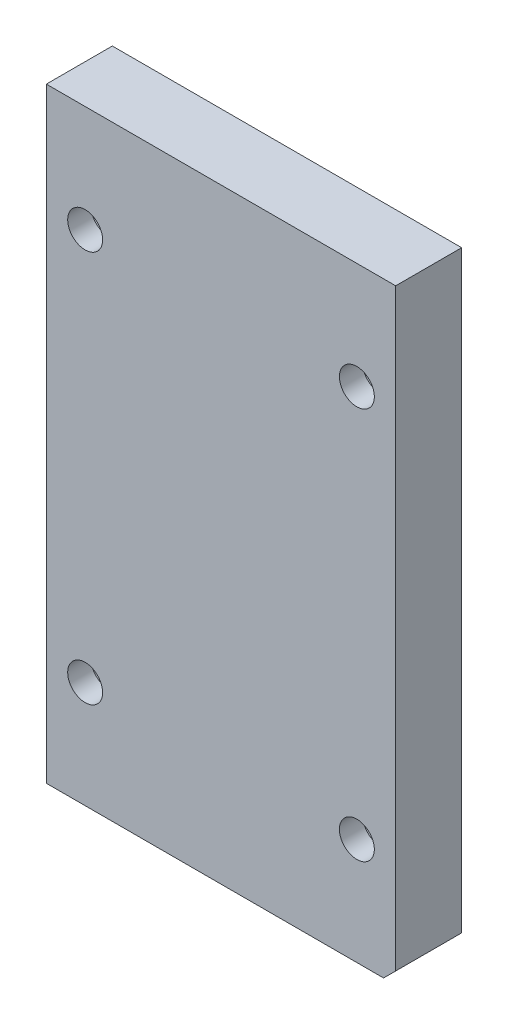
ISO-10303-21;
HEADER;
FILE_DESCRIPTION(('STEP AP214'),'2;1');
FILE_NAME('part.step','',(''),(''),'','','');
FILE_SCHEMA(('AUTOMOTIVE_DESIGN { 1 0 10303 214 1 1 1 1 }'));
ENDSEC;
DATA;
#1=APPLICATION_CONTEXT('core data for automotive mechanical design processes');
#2=APPLICATION_PROTOCOL_DEFINITION('international standard','automotive_design',2000,#1);
#3=PRODUCT_CONTEXT('',#1,'mechanical');
#4=PRODUCT('Part','Part','',(#3));
#5=PRODUCT_RELATED_PRODUCT_CATEGORY('part','',(#4));
#6=PRODUCT_DEFINITION_FORMATION('','',#4);
#7=PRODUCT_DEFINITION_CONTEXT('part definition',#1,'design');
#8=PRODUCT_DEFINITION('design','',#6,#7);
#9=PRODUCT_DEFINITION_SHAPE('','',#8);
#10=(LENGTH_UNIT() NAMED_UNIT(*) SI_UNIT(.MILLI.,.METRE.));
#11=(NAMED_UNIT(*) PLANE_ANGLE_UNIT() SI_UNIT($,.RADIAN.));
#12=(NAMED_UNIT(*) SI_UNIT($,.STERADIAN.) SOLID_ANGLE_UNIT());
#13=UNCERTAINTY_MEASURE_WITH_UNIT(LENGTH_MEASURE(1.E-05),#10,'distance_accuracy_value','');
#14=(GEOMETRIC_REPRESENTATION_CONTEXT(3) GLOBAL_UNCERTAINTY_ASSIGNED_CONTEXT((#13)) GLOBAL_UNIT_ASSIGNED_CONTEXT((#10,
#11,#12)) REPRESENTATION_CONTEXT('',''));
#15=CARTESIAN_POINT('',(0.,0.,0.));
#16=DIRECTION('',(0.,0.,1.));
#17=DIRECTION('',(1.,0.,0.));
#18=AXIS2_PLACEMENT_3D('',#15,#16,#17);
#19=CARTESIAN_POINT('',(-45.,78.,-197.099972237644));
#20=DIRECTION('',(0.,1.,0.));
#21=DIRECTION('',(-1.,0.,0.));
#22=AXIS2_PLACEMENT_3D('',#19,#20,#21);
#23=PLANE('',#22);
#24=DIRECTION('',(1.,0.,0.));
#25=VECTOR('',#24,1.);
#26=CARTESIAN_POINT('',(-45.,78.,-17.));
#27=LINE('',#26,#25);
#28=CARTESIAN_POINT('',(-45.,78.,-17.));
#29=VERTEX_POINT('',#28);
#30=CARTESIAN_POINT('',(45.,78.,-17.));
#31=VERTEX_POINT('',#30);
#32=EDGE_CURVE('E197',#29,#31,#27,.T.);
#33=ORIENTED_EDGE('',*,*,#32,.F.);
#34=DIRECTION('',(0.,0.,1.));
#35=VECTOR('',#34,1.);
#36=CARTESIAN_POINT('',(-45.,78.,-197.099972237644));
#37=LINE('',#36,#35);
#38=CARTESIAN_POINT('',(-45.,78.,0.));
#39=VERTEX_POINT('',#38);
#40=EDGE_CURVE('E209',#29,#39,#37,.T.);
#41=ORIENTED_EDGE('',*,*,#40,.T.);
#42=DIRECTION('',(-1.,0.,0.));
#43=VECTOR('',#42,1.);
#44=CARTESIAN_POINT('',(-45.,78.,0.));
#45=LINE('',#44,#43);
#46=CARTESIAN_POINT('',(45.,78.,0.));
#47=VERTEX_POINT('',#46);
#48=EDGE_CURVE('E191',#47,#39,#45,.T.);
#49=ORIENTED_EDGE('',*,*,#48,.F.);
#50=DIRECTION('',(0.,0.,1.));
#51=VECTOR('',#50,1.);
#52=CARTESIAN_POINT('',(45.,78.,-197.099972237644));
#53=LINE('',#52,#51);
#54=EDGE_CURVE('E195',#31,#47,#53,.T.);
#55=ORIENTED_EDGE('',*,*,#54,.F.);
#56=EDGE_LOOP('',(#33,#41,#49,#55));
#57=FACE_BOUND('',#56,.T.);
#58=ADVANCED_FACE('F34',(#57),#23,.T.);
#59=CARTESIAN_POINT('',(45.,78.,-197.099972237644));
#60=DIRECTION('',(1.,0.,0.));
#61=DIRECTION('',(0.,1.,0.));
#62=AXIS2_PLACEMENT_3D('',#59,#60,#61);
#63=PLANE('',#62);
#64=DIRECTION('',(0.,1.,0.));
#65=VECTOR('',#64,1.);
#66=CARTESIAN_POINT('',(45.,78.,0.));
#67=LINE('',#66,#65);
#68=CARTESIAN_POINT('',(45.,-74.8799999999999,0.));
#69=VERTEX_POINT('',#68);
#70=EDGE_CURVE('E207',#69,#47,#67,.T.);
#71=ORIENTED_EDGE('',*,*,#70,.F.);
#72=DIRECTION('',(0.,0.,-1.));
#73=VECTOR('',#72,1.);
#74=CARTESIAN_POINT('',(45.,-74.8799999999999,-197.099972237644));
#75=LINE('',#74,#73);
#76=CARTESIAN_POINT('',(45.,-74.8799999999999,-17.));
#77=VERTEX_POINT('',#76);
#78=EDGE_CURVE('E42',#69,#77,#75,.T.);
#79=ORIENTED_EDGE('',*,*,#78,.T.);
#80=DIRECTION('',(0.,-1.,0.));
#81=VECTOR('',#80,1.);
#82=CARTESIAN_POINT('',(45.,78.,-17.));
#83=LINE('',#82,#81);
#84=EDGE_CURVE('E194',#31,#77,#83,.T.);
#85=ORIENTED_EDGE('',*,*,#84,.F.);
#86=ORIENTED_EDGE('',*,*,#54,.T.);
#87=EDGE_LOOP('',(#71,#79,#85,#86));
#88=FACE_BOUND('',#87,.T.);
#89=ADVANCED_FACE('F239',(#88),#63,.T.);
#90=CARTESIAN_POINT('',(-45.,-78.,-197.099972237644));
#91=DIRECTION('',(0.,-1.,0.));
#92=DIRECTION('',(1.,0.,0.));
#93=AXIS2_PLACEMENT_3D('',#90,#91,#92);
#94=PLANE('',#93);
#95=DIRECTION('',(-1.,0.,0.));
#96=VECTOR('',#95,1.);
#97=CARTESIAN_POINT('',(-45.,-78.,-17.));
#98=LINE('',#97,#96);
#99=CARTESIAN_POINT('',(41.88,-78.,-17.));
#100=VERTEX_POINT('',#99);
#101=CARTESIAN_POINT('',(-45.,-78.,-17.));
#102=VERTEX_POINT('',#101);
#103=EDGE_CURVE('E192',#100,#102,#98,.T.);
#104=ORIENTED_EDGE('',*,*,#103,.F.);
#105=DIRECTION('',(0.,0.,1.));
#106=VECTOR('',#105,1.);
#107=CARTESIAN_POINT('',(41.88,-78.,-197.099972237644));
#108=LINE('',#107,#106);
#109=CARTESIAN_POINT('',(41.8799999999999,-78.,0.));
#110=VERTEX_POINT('',#109);
#111=EDGE_CURVE('E216',#100,#110,#108,.T.);
#112=ORIENTED_EDGE('',*,*,#111,.T.);
#113=DIRECTION('',(1.,0.,0.));
#114=VECTOR('',#113,1.);
#115=CARTESIAN_POINT('',(-45.,-78.,0.));
#116=LINE('',#115,#114);
#117=CARTESIAN_POINT('',(-45.,-78.,0.));
#118=VERTEX_POINT('',#117);
#119=EDGE_CURVE('E205',#118,#110,#116,.T.);
#120=ORIENTED_EDGE('',*,*,#119,.F.);
#121=DIRECTION('',(0.,0.,1.));
#122=VECTOR('',#121,1.);
#123=CARTESIAN_POINT('',(-45.,-78.,-197.099972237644));
#124=LINE('',#123,#122);
#125=EDGE_CURVE('E212',#102,#118,#124,.T.);
#126=ORIENTED_EDGE('',*,*,#125,.F.);
#127=EDGE_LOOP('',(#104,#112,#120,#126));
#128=FACE_BOUND('',#127,.T.);
#129=ADVANCED_FACE('F223',(#128),#94,.T.);
#130=CARTESIAN_POINT('',(-45.,78.,-197.099972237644));
#131=DIRECTION('',(-1.,0.,0.));
#132=DIRECTION('',(0.,-1.,0.));
#133=AXIS2_PLACEMENT_3D('',#130,#131,#132);
#134=PLANE('',#133);
#135=DIRECTION('',(0.,1.,0.));
#136=VECTOR('',#135,1.);
#137=CARTESIAN_POINT('',(-45.,78.,-17.));
#138=LINE('',#137,#136);
#139=EDGE_CURVE('E199',#102,#29,#138,.T.);
#140=ORIENTED_EDGE('',*,*,#139,.F.);
#141=ORIENTED_EDGE('',*,*,#125,.T.);
#142=DIRECTION('',(0.,-1.,0.));
#143=VECTOR('',#142,1.);
#144=CARTESIAN_POINT('',(-45.,78.,0.));
#145=LINE('',#144,#143);
#146=EDGE_CURVE('E202',#39,#118,#145,.T.);
#147=ORIENTED_EDGE('',*,*,#146,.F.);
#148=ORIENTED_EDGE('',*,*,#40,.F.);
#149=EDGE_LOOP('',(#140,#141,#147,#148));
#150=FACE_BOUND('',#149,.T.);
#151=ADVANCED_FACE('F233',(#150),#134,.T.);
#152=CARTESIAN_POINT('',(0.,0.,0.));
#153=DIRECTION('',(0.,0.,-1.));
#154=DIRECTION('',(-1.,0.,0.));
#155=AXIS2_PLACEMENT_3D('',#152,#153,#154);
#156=PLANE('',#155);
#157=CARTESIAN_POINT('',(34.9999999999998,-50.5,0.));
#158=DIRECTION('',(0.,0.,-1.));
#159=DIRECTION('',(-1.,0.,0.));
#160=AXIS2_PLACEMENT_3D('',#157,#158,#159);
#161=CIRCLE('',#160,4.5);
#162=CARTESIAN_POINT('',(30.4999999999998,-50.5,0.));
#163=VERTEX_POINT('',#162);
#164=EDGE_CURVE('E152',#163,#163,#161,.T.);
#165=ORIENTED_EDGE('',*,*,#164,.T.);
#166=EDGE_LOOP('',(#165));
#167=FACE_BOUND('',#166,.T.);
#168=CARTESIAN_POINT('',(-35.,-50.5000000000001,0.));
#169=DIRECTION('',(0.,0.,-1.));
#170=DIRECTION('',(-1.,0.,0.));
#171=AXIS2_PLACEMENT_3D('',#168,#169,#170);
#172=CIRCLE('',#171,4.5);
#173=CARTESIAN_POINT('',(-39.5,-50.5000000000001,0.));
#174=VERTEX_POINT('',#173);
#175=EDGE_CURVE('E164',#174,#174,#172,.T.);
#176=ORIENTED_EDGE('',*,*,#175,.T.);
#177=EDGE_LOOP('',(#176));
#178=FACE_BOUND('',#177,.T.);
#179=CARTESIAN_POINT('',(-35.,50.5,0.));
#180=DIRECTION('',(0.,0.,-1.));
#181=DIRECTION('',(-1.,0.,0.));
#182=AXIS2_PLACEMENT_3D('',#179,#180,#181);
#183=CIRCLE('',#182,4.5);
#184=CARTESIAN_POINT('',(-39.5,50.5,0.));
#185=VERTEX_POINT('',#184);
#186=EDGE_CURVE('E176',#185,#185,#183,.T.);
#187=ORIENTED_EDGE('',*,*,#186,.T.);
#188=EDGE_LOOP('',(#187));
#189=FACE_BOUND('',#188,.T.);
#190=CARTESIAN_POINT('',(35.,50.5,0.));
#191=DIRECTION('',(0.,0.,-1.));
#192=DIRECTION('',(-1.,0.,0.));
#193=AXIS2_PLACEMENT_3D('',#190,#191,#192);
#194=CIRCLE('',#193,4.5);
#195=CARTESIAN_POINT('',(30.5,50.5,0.));
#196=VERTEX_POINT('',#195);
#197=EDGE_CURVE('E188',#196,#196,#194,.T.);
#198=ORIENTED_EDGE('',*,*,#197,.T.);
#199=EDGE_LOOP('',(#198));
#200=FACE_BOUND('',#199,.T.);
#201=ORIENTED_EDGE('',*,*,#119,.T.);
#202=DIRECTION('',(-0.707106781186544,-0.707106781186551,0.));
#203=VECTOR('',#202,1.);
#204=CARTESIAN_POINT('',(41.88,-78.,0.));
#205=LINE('',#204,#203);
#206=EDGE_CURVE('E56',#110,#69,#205,.F.);
#207=ORIENTED_EDGE('',*,*,#206,.T.);
#208=ORIENTED_EDGE('',*,*,#70,.T.);
#209=ORIENTED_EDGE('',*,*,#48,.T.);
#210=ORIENTED_EDGE('',*,*,#146,.T.);
#211=EDGE_LOOP('',(#201,#207,#208,#209,#210));
#212=FACE_BOUND('',#211,.T.);
#213=ADVANCED_FACE('F227',(#167,#178,#189,#200,#212),#156,.F.);
#214=CARTESIAN_POINT('',(0.,0.,-17.));
#215=DIRECTION('',(0.,0.,1.));
#216=DIRECTION('',(1.,0.,0.));
#217=AXIS2_PLACEMENT_3D('',#214,#215,#216);
#218=PLANE('',#217);
#219=CARTESIAN_POINT('',(35.0000000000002,-68.,-17.0000000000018));
#220=DIRECTION('',(0.,0.,-1.));
#221=DIRECTION('',(-1.,0.,0.));
#222=AXIS2_PLACEMENT_3D('',#219,#220,#221);
#223=CIRCLE('',#222,2.);
#224=CARTESIAN_POINT('',(33.0000000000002,-68.,-17.0000000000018));
#225=VERTEX_POINT('',#224);
#226=EDGE_CURVE('E369',#225,#225,#223,.T.);
#227=ORIENTED_EDGE('',*,*,#226,.F.);
#228=EDGE_LOOP('',(#227));
#229=FACE_BOUND('',#228,.T.);
#230=CARTESIAN_POINT('',(-34.9999999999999,-68.,-17.0000000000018));
#231=DIRECTION('',(0.,0.,-1.));
#232=DIRECTION('',(-1.,0.,0.));
#233=AXIS2_PLACEMENT_3D('',#230,#231,#232);
#234=CIRCLE('',#233,2.);
#235=CARTESIAN_POINT('',(-36.9999999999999,-68.,-17.0000000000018));
#236=VERTEX_POINT('',#235);
#237=EDGE_CURVE('E100',#236,#236,#234,.T.);
#238=ORIENTED_EDGE('',*,*,#237,.F.);
#239=EDGE_LOOP('',(#238));
#240=FACE_BOUND('',#239,.T.);
#241=CARTESIAN_POINT('',(-34.9999999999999,68.,-17.0000000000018));
#242=DIRECTION('',(0.,0.,-1.));
#243=DIRECTION('',(-1.,0.,0.));
#244=AXIS2_PLACEMENT_3D('',#241,#242,#243);
#245=CIRCLE('',#244,2.);
#246=CARTESIAN_POINT('',(-36.9999999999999,68.,-17.0000000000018));
#247=VERTEX_POINT('',#246);
#248=EDGE_CURVE('E119',#247,#247,#245,.T.);
#249=ORIENTED_EDGE('',*,*,#248,.F.);
#250=EDGE_LOOP('',(#249));
#251=FACE_BOUND('',#250,.T.);
#252=CARTESIAN_POINT('',(35.0000000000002,68.,-17.0000000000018));
#253=DIRECTION('',(0.,0.,-1.));
#254=DIRECTION('',(-1.,0.,0.));
#255=AXIS2_PLACEMENT_3D('',#252,#253,#254);
#256=CIRCLE('',#255,2.);
#257=CARTESIAN_POINT('',(33.0000000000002,68.,-17.0000000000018));
#258=VERTEX_POINT('',#257);
#259=EDGE_CURVE('E131',#258,#258,#256,.T.);
#260=ORIENTED_EDGE('',*,*,#259,.F.);
#261=EDGE_LOOP('',(#260));
#262=FACE_BOUND('',#261,.T.);
#263=CARTESIAN_POINT('',(34.9999999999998,-50.5,-17.));
#264=DIRECTION('',(0.,0.,-1.));
#265=DIRECTION('',(-1.,0.,0.));
#266=AXIS2_PLACEMENT_3D('',#263,#264,#265);
#267=CIRCLE('',#266,7.50000000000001);
#268=CARTESIAN_POINT('',(27.4999999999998,-50.5,-17.));
#269=VERTEX_POINT('',#268);
#270=EDGE_CURVE('E143',#269,#269,#267,.T.);
#271=ORIENTED_EDGE('',*,*,#270,.F.);
#272=EDGE_LOOP('',(#271));
#273=FACE_BOUND('',#272,.T.);
#274=CARTESIAN_POINT('',(-35.,-50.5000000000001,-17.));
#275=DIRECTION('',(0.,0.,-1.));
#276=DIRECTION('',(-1.,0.,0.));
#277=AXIS2_PLACEMENT_3D('',#274,#275,#276);
#278=CIRCLE('',#277,7.50000000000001);
#279=CARTESIAN_POINT('',(-42.5,-50.5000000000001,-17.));
#280=VERTEX_POINT('',#279);
#281=EDGE_CURVE('E155',#280,#280,#278,.T.);
#282=ORIENTED_EDGE('',*,*,#281,.F.);
#283=EDGE_LOOP('',(#282));
#284=FACE_BOUND('',#283,.T.);
#285=CARTESIAN_POINT('',(-35.,50.5,-17.));
#286=DIRECTION('',(0.,0.,-1.));
#287=DIRECTION('',(-1.,0.,0.));
#288=AXIS2_PLACEMENT_3D('',#285,#286,#287);
#289=CIRCLE('',#288,7.50000000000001);
#290=CARTESIAN_POINT('',(-42.5,50.5,-17.));
#291=VERTEX_POINT('',#290);
#292=EDGE_CURVE('E167',#291,#291,#289,.T.);
#293=ORIENTED_EDGE('',*,*,#292,.F.);
#294=EDGE_LOOP('',(#293));
#295=FACE_BOUND('',#294,.T.);
#296=CARTESIAN_POINT('',(35.,50.5,-17.));
#297=DIRECTION('',(0.,0.,-1.));
#298=DIRECTION('',(-1.,0.,0.));
#299=AXIS2_PLACEMENT_3D('',#296,#297,#298);
#300=CIRCLE('',#299,7.50000000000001);
#301=CARTESIAN_POINT('',(27.5,50.5,-17.));
#302=VERTEX_POINT('',#301);
#303=EDGE_CURVE('E179',#302,#302,#300,.T.);
#304=ORIENTED_EDGE('',*,*,#303,.F.);
#305=EDGE_LOOP('',(#304));
#306=FACE_BOUND('',#305,.T.);
#307=ORIENTED_EDGE('',*,*,#84,.T.);
#308=DIRECTION('',(0.707106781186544,0.707106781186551,0.));
#309=VECTOR('',#308,1.);
#310=CARTESIAN_POINT('',(41.88,-78.,-17.));
#311=LINE('',#310,#309);
#312=EDGE_CURVE('E11',#77,#100,#311,.F.);
#313=ORIENTED_EDGE('',*,*,#312,.T.);
#314=ORIENTED_EDGE('',*,*,#103,.T.);
#315=ORIENTED_EDGE('',*,*,#139,.T.);
#316=ORIENTED_EDGE('',*,*,#32,.T.);
#317=EDGE_LOOP('',(#307,#313,#314,#315,#316));
#318=FACE_BOUND('',#317,.T.);
#319=ADVANCED_FACE('F236',(#229,#240,#251,#262,#273,#284,#295,#306,#318),#218,.F.);
#320=CARTESIAN_POINT('',(35.,50.5,-17.));
#321=DIRECTION('',(0.,0.,-1.));
#322=DIRECTION('',(-1.,0.,0.));
#323=AXIS2_PLACEMENT_3D('',#320,#321,#322);
#324=CYLINDRICAL_SURFACE('',#323,4.5);
#325=ORIENTED_EDGE('',*,*,#197,.F.);
#326=EDGE_LOOP('',(#325));
#327=FACE_BOUND('',#326,.T.);
#328=CARTESIAN_POINT('',(35.,50.5,-6.00000000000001));
#329=DIRECTION('',(0.,0.,-1.));
#330=DIRECTION('',(-1.,0.,0.));
#331=AXIS2_PLACEMENT_3D('',#328,#329,#330);
#332=CIRCLE('',#331,4.5);
#333=CARTESIAN_POINT('',(30.5,50.5,-6.00000000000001));
#334=VERTEX_POINT('',#333);
#335=EDGE_CURVE('E185',#334,#334,#332,.T.);
#336=ORIENTED_EDGE('',*,*,#335,.T.);
#337=EDGE_LOOP('',(#336));
#338=FACE_BOUND('',#337,.T.);
#339=ADVANCED_FACE('F263',(#327,#338),#324,.F.);
#340=CARTESIAN_POINT('',(39.5,50.5,-6.));
#341=DIRECTION('',(0.,0.,1.));
#342=DIRECTION('',(1.,0.,0.));
#343=AXIS2_PLACEMENT_3D('',#340,#341,#342);
#344=PLANE('',#343);
#345=ORIENTED_EDGE('',*,*,#335,.F.);
#346=EDGE_LOOP('',(#345));
#347=FACE_BOUND('',#346,.T.);
#348=CARTESIAN_POINT('',(35.,50.5,-6.));
#349=DIRECTION('',(0.,0.,-1.));
#350=DIRECTION('',(-1.,0.,0.));
#351=AXIS2_PLACEMENT_3D('',#348,#349,#350);
#352=CIRCLE('',#351,7.50000000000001);
#353=CARTESIAN_POINT('',(27.5,50.5,-6.));
#354=VERTEX_POINT('',#353);
#355=EDGE_CURVE('E182',#354,#354,#352,.T.);
#356=ORIENTED_EDGE('',*,*,#355,.T.);
#357=EDGE_LOOP('',(#356));
#358=FACE_BOUND('',#357,.T.);
#359=ADVANCED_FACE('F267',(#347,#358),#344,.F.);
#360=CARTESIAN_POINT('',(35.,50.5,-17.));
#361=DIRECTION('',(0.,0.,-1.));
#362=DIRECTION('',(-1.,0.,0.));
#363=AXIS2_PLACEMENT_3D('',#360,#361,#362);
#364=CYLINDRICAL_SURFACE('',#363,7.50000000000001);
#365=ORIENTED_EDGE('',*,*,#355,.F.);
#366=EDGE_LOOP('',(#365));
#367=FACE_BOUND('',#366,.T.);
#368=ORIENTED_EDGE('',*,*,#303,.T.);
#369=EDGE_LOOP('',(#368));
#370=FACE_BOUND('',#369,.T.);
#371=ADVANCED_FACE('F271',(#367,#370),#364,.F.);
#372=CARTESIAN_POINT('',(-35.,50.5,-17.));
#373=DIRECTION('',(0.,0.,-1.));
#374=DIRECTION('',(-1.,0.,0.));
#375=AXIS2_PLACEMENT_3D('',#372,#373,#374);
#376=CYLINDRICAL_SURFACE('',#375,4.5);
#377=ORIENTED_EDGE('',*,*,#186,.F.);
#378=EDGE_LOOP('',(#377));
#379=FACE_BOUND('',#378,.T.);
#380=CARTESIAN_POINT('',(-35.,50.5,-6.00000000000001));
#381=DIRECTION('',(0.,0.,-1.));
#382=DIRECTION('',(-1.,0.,0.));
#383=AXIS2_PLACEMENT_3D('',#380,#381,#382);
#384=CIRCLE('',#383,4.5);
#385=CARTESIAN_POINT('',(-39.5,50.5,-6.00000000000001));
#386=VERTEX_POINT('',#385);
#387=EDGE_CURVE('E173',#386,#386,#384,.T.);
#388=ORIENTED_EDGE('',*,*,#387,.T.);
#389=EDGE_LOOP('',(#388));
#390=FACE_BOUND('',#389,.T.);
#391=ADVANCED_FACE('F275',(#379,#390),#376,.F.);
#392=CARTESIAN_POINT('',(-30.5,50.5,-6.));
#393=DIRECTION('',(0.,0.,1.));
#394=DIRECTION('',(1.,0.,0.));
#395=AXIS2_PLACEMENT_3D('',#392,#393,#394);
#396=PLANE('',#395);
#397=ORIENTED_EDGE('',*,*,#387,.F.);
#398=EDGE_LOOP('',(#397));
#399=FACE_BOUND('',#398,.T.);
#400=CARTESIAN_POINT('',(-35.,50.5,-6.));
#401=DIRECTION('',(0.,0.,-1.));
#402=DIRECTION('',(-1.,0.,0.));
#403=AXIS2_PLACEMENT_3D('',#400,#401,#402);
#404=CIRCLE('',#403,7.5);
#405=CARTESIAN_POINT('',(-42.5,50.5,-6.));
#406=VERTEX_POINT('',#405);
#407=EDGE_CURVE('E170',#406,#406,#404,.T.);
#408=ORIENTED_EDGE('',*,*,#407,.T.);
#409=EDGE_LOOP('',(#408));
#410=FACE_BOUND('',#409,.T.);
#411=ADVANCED_FACE('F279',(#399,#410),#396,.F.);
#412=CARTESIAN_POINT('',(-35.,50.5,-17.));
#413=DIRECTION('',(0.,0.,-1.));
#414=DIRECTION('',(-1.,0.,0.));
#415=AXIS2_PLACEMENT_3D('',#412,#413,#414);
#416=CYLINDRICAL_SURFACE('',#415,7.50000000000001);
#417=ORIENTED_EDGE('',*,*,#407,.F.);
#418=EDGE_LOOP('',(#417));
#419=FACE_BOUND('',#418,.T.);
#420=ORIENTED_EDGE('',*,*,#292,.T.);
#421=EDGE_LOOP('',(#420));
#422=FACE_BOUND('',#421,.T.);
#423=ADVANCED_FACE('F283',(#419,#422),#416,.F.);
#424=CARTESIAN_POINT('',(-35.,-50.5000000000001,-17.));
#425=DIRECTION('',(0.,0.,-1.));
#426=DIRECTION('',(-1.,0.,0.));
#427=AXIS2_PLACEMENT_3D('',#424,#425,#426);
#428=CYLINDRICAL_SURFACE('',#427,4.5);
#429=ORIENTED_EDGE('',*,*,#175,.F.);
#430=EDGE_LOOP('',(#429));
#431=FACE_BOUND('',#430,.T.);
#432=CARTESIAN_POINT('',(-35.,-50.5000000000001,-6.00000000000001));
#433=DIRECTION('',(0.,0.,-1.));
#434=DIRECTION('',(-1.,0.,0.));
#435=AXIS2_PLACEMENT_3D('',#432,#433,#434);
#436=CIRCLE('',#435,4.5);
#437=CARTESIAN_POINT('',(-39.5,-50.5000000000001,-6.00000000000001));
#438=VERTEX_POINT('',#437);
#439=EDGE_CURVE('E161',#438,#438,#436,.T.);
#440=ORIENTED_EDGE('',*,*,#439,.T.);
#441=EDGE_LOOP('',(#440));
#442=FACE_BOUND('',#441,.T.);
#443=ADVANCED_FACE('F287',(#431,#442),#428,.F.);
#444=CARTESIAN_POINT('',(-30.5,-50.5000000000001,-6.));
#445=DIRECTION('',(0.,0.,1.));
#446=DIRECTION('',(1.,0.,0.));
#447=AXIS2_PLACEMENT_3D('',#444,#445,#446);
#448=PLANE('',#447);
#449=ORIENTED_EDGE('',*,*,#439,.F.);
#450=EDGE_LOOP('',(#449));
#451=FACE_BOUND('',#450,.T.);
#452=CARTESIAN_POINT('',(-35.,-50.5000000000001,-6.));
#453=DIRECTION('',(0.,0.,-1.));
#454=DIRECTION('',(-1.,0.,0.));
#455=AXIS2_PLACEMENT_3D('',#452,#453,#454);
#456=CIRCLE('',#455,7.5);
#457=CARTESIAN_POINT('',(-42.5,-50.5000000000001,-6.));
#458=VERTEX_POINT('',#457);
#459=EDGE_CURVE('E158',#458,#458,#456,.T.);
#460=ORIENTED_EDGE('',*,*,#459,.T.);
#461=EDGE_LOOP('',(#460));
#462=FACE_BOUND('',#461,.T.);
#463=ADVANCED_FACE('F291',(#451,#462),#448,.F.);
#464=CARTESIAN_POINT('',(-35.,-50.5000000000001,-17.));
#465=DIRECTION('',(0.,0.,-1.));
#466=DIRECTION('',(-1.,0.,0.));
#467=AXIS2_PLACEMENT_3D('',#464,#465,#466);
#468=CYLINDRICAL_SURFACE('',#467,7.50000000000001);
#469=ORIENTED_EDGE('',*,*,#459,.F.);
#470=EDGE_LOOP('',(#469));
#471=FACE_BOUND('',#470,.T.);
#472=ORIENTED_EDGE('',*,*,#281,.T.);
#473=EDGE_LOOP('',(#472));
#474=FACE_BOUND('',#473,.T.);
#475=ADVANCED_FACE('F295',(#471,#474),#468,.F.);
#476=CARTESIAN_POINT('',(34.9999999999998,-50.5,-17.));
#477=DIRECTION('',(0.,0.,-1.));
#478=DIRECTION('',(-1.,0.,0.));
#479=AXIS2_PLACEMENT_3D('',#476,#477,#478);
#480=CYLINDRICAL_SURFACE('',#479,4.5);
#481=ORIENTED_EDGE('',*,*,#164,.F.);
#482=EDGE_LOOP('',(#481));
#483=FACE_BOUND('',#482,.T.);
#484=CARTESIAN_POINT('',(34.9999999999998,-50.5,-6.00000000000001));
#485=DIRECTION('',(0.,0.,-1.));
#486=DIRECTION('',(-1.,0.,0.));
#487=AXIS2_PLACEMENT_3D('',#484,#485,#486);
#488=CIRCLE('',#487,4.5);
#489=CARTESIAN_POINT('',(30.4999999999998,-50.5,-6.00000000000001));
#490=VERTEX_POINT('',#489);
#491=EDGE_CURVE('E149',#490,#490,#488,.T.);
#492=ORIENTED_EDGE('',*,*,#491,.T.);
#493=EDGE_LOOP('',(#492));
#494=FACE_BOUND('',#493,.T.);
#495=ADVANCED_FACE('F299',(#483,#494),#480,.F.);
#496=CARTESIAN_POINT('',(39.4999999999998,-50.5,-6.));
#497=DIRECTION('',(0.,0.,1.));
#498=DIRECTION('',(1.,0.,0.));
#499=AXIS2_PLACEMENT_3D('',#496,#497,#498);
#500=PLANE('',#499);
#501=ORIENTED_EDGE('',*,*,#491,.F.);
#502=EDGE_LOOP('',(#501));
#503=FACE_BOUND('',#502,.T.);
#504=CARTESIAN_POINT('',(34.9999999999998,-50.5,-6.));
#505=DIRECTION('',(0.,0.,-1.));
#506=DIRECTION('',(-1.,0.,0.));
#507=AXIS2_PLACEMENT_3D('',#504,#505,#506);
#508=CIRCLE('',#507,7.50000000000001);
#509=CARTESIAN_POINT('',(27.4999999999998,-50.5,-6.));
#510=VERTEX_POINT('',#509);
#511=EDGE_CURVE('E146',#510,#510,#508,.T.);
#512=ORIENTED_EDGE('',*,*,#511,.T.);
#513=EDGE_LOOP('',(#512));
#514=FACE_BOUND('',#513,.T.);
#515=ADVANCED_FACE('F303',(#503,#514),#500,.F.);
#516=CARTESIAN_POINT('',(34.9999999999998,-50.5,-17.));
#517=DIRECTION('',(0.,0.,-1.));
#518=DIRECTION('',(-1.,0.,0.));
#519=AXIS2_PLACEMENT_3D('',#516,#517,#518);
#520=CYLINDRICAL_SURFACE('',#519,7.50000000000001);
#521=ORIENTED_EDGE('',*,*,#511,.F.);
#522=EDGE_LOOP('',(#521));
#523=FACE_BOUND('',#522,.T.);
#524=ORIENTED_EDGE('',*,*,#270,.T.);
#525=EDGE_LOOP('',(#524));
#526=FACE_BOUND('',#525,.T.);
#527=ADVANCED_FACE('F307',(#523,#526),#520,.F.);
#528=CARTESIAN_POINT('',(35.0000000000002,68.,-5.9914200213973));
#529=DIRECTION('',(0.,0.,-1.));
#530=DIRECTION('',(-1.,0.,0.));
#531=AXIS2_PLACEMENT_3D('',#528,#529,#530);
#532=CONICAL_SURFACE('',#531,1.65,1.02974425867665);
#533=CARTESIAN_POINT('',(35.0000000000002,68.,-5.00000000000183));
#534=VERTEX_POINT('',#533);
#535=VERTEX_LOOP('',#534);
#536=FACE_BOUND('',#535,.T.);
#537=CARTESIAN_POINT('',(35.0000000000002,68.,-5.9914200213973));
#538=DIRECTION('',(0.,0.,-1.));
#539=DIRECTION('',(-1.,0.,0.));
#540=AXIS2_PLACEMENT_3D('',#537,#538,#539);
#541=CIRCLE('',#540,1.65);
#542=CARTESIAN_POINT('',(33.3500000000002,68.,-5.9914200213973));
#543=VERTEX_POINT('',#542);
#544=EDGE_CURVE('E140',#543,#543,#541,.T.);
#545=ORIENTED_EDGE('',*,*,#544,.T.);
#546=EDGE_LOOP('',(#545));
#547=FACE_BOUND('',#546,.T.);
#548=ADVANCED_FACE('F311',(#536,#547),#532,.F.);
#549=CARTESIAN_POINT('',(35.0000000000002,68.,-17.0000000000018));
#550=DIRECTION('',(0.,0.,-1.));
#551=DIRECTION('',(-1.,0.,0.));
#552=AXIS2_PLACEMENT_3D('',#549,#550,#551);
#553=CYLINDRICAL_SURFACE('',#552,1.65);
#554=ORIENTED_EDGE('',*,*,#544,.F.);
#555=EDGE_LOOP('',(#554));
#556=FACE_BOUND('',#555,.T.);
#557=CARTESIAN_POINT('',(35.0000000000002,68.,-10.0000000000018));
#558=DIRECTION('',(0.,0.,-1.));
#559=DIRECTION('',(-1.,0.,0.));
#560=AXIS2_PLACEMENT_3D('',#557,#558,#559);
#561=CIRCLE('',#560,1.65);
#562=CARTESIAN_POINT('',(33.3500000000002,68.,-10.0000000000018));
#563=VERTEX_POINT('',#562);
#564=EDGE_CURVE('E137',#563,#563,#561,.T.);
#565=ORIENTED_EDGE('',*,*,#564,.T.);
#566=EDGE_LOOP('',(#565));
#567=FACE_BOUND('',#566,.T.);
#568=ADVANCED_FACE('F315',(#556,#567),#553,.F.);
#569=CARTESIAN_POINT('',(36.6500000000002,68.,-10.0000000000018));
#570=DIRECTION('',(0.,0.,1.));
#571=DIRECTION('',(1.,0.,0.));
#572=AXIS2_PLACEMENT_3D('',#569,#570,#571);
#573=PLANE('',#572);
#574=ORIENTED_EDGE('',*,*,#564,.F.);
#575=EDGE_LOOP('',(#574));
#576=FACE_BOUND('',#575,.T.);
#577=CARTESIAN_POINT('',(35.0000000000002,68.,-10.0000000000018));
#578=DIRECTION('',(0.,0.,-1.));
#579=DIRECTION('',(-1.,0.,0.));
#580=AXIS2_PLACEMENT_3D('',#577,#578,#579);
#581=CIRCLE('',#580,2.);
#582=CARTESIAN_POINT('',(33.0000000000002,68.,-10.0000000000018));
#583=VERTEX_POINT('',#582);
#584=EDGE_CURVE('E134',#583,#583,#581,.T.);
#585=ORIENTED_EDGE('',*,*,#584,.T.);
#586=EDGE_LOOP('',(#585));
#587=FACE_BOUND('',#586,.T.);
#588=ADVANCED_FACE('F319',(#576,#587),#573,.F.);
#589=CARTESIAN_POINT('',(35.0000000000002,68.,-17.0000000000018));
#590=DIRECTION('',(0.,0.,-1.));
#591=DIRECTION('',(-1.,0.,0.));
#592=AXIS2_PLACEMENT_3D('',#589,#590,#591);
#593=CYLINDRICAL_SURFACE('',#592,2.);
#594=ORIENTED_EDGE('',*,*,#584,.F.);
#595=EDGE_LOOP('',(#594));
#596=FACE_BOUND('',#595,.T.);
#597=ORIENTED_EDGE('',*,*,#259,.T.);
#598=EDGE_LOOP('',(#597));
#599=FACE_BOUND('',#598,.T.);
#600=ADVANCED_FACE('F323',(#596,#599),#593,.F.);
#601=CARTESIAN_POINT('',(-34.9999999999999,68.,-5.9914200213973));
#602=DIRECTION('',(0.,0.,-1.));
#603=DIRECTION('',(-1.,0.,0.));
#604=AXIS2_PLACEMENT_3D('',#601,#602,#603);
#605=CONICAL_SURFACE('',#604,1.65,1.02974425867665);
#606=CARTESIAN_POINT('',(-34.9999999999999,68.,-5.00000000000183));
#607=VERTEX_POINT('',#606);
#608=VERTEX_LOOP('',#607);
#609=FACE_BOUND('',#608,.T.);
#610=CARTESIAN_POINT('',(-34.9999999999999,68.,-5.9914200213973));
#611=DIRECTION('',(0.,0.,-1.));
#612=DIRECTION('',(-1.,0.,0.));
#613=AXIS2_PLACEMENT_3D('',#610,#611,#612);
#614=CIRCLE('',#613,1.65);
#615=CARTESIAN_POINT('',(-36.6499999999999,68.,-5.9914200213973));
#616=VERTEX_POINT('',#615);
#617=EDGE_CURVE('E128',#616,#616,#614,.T.);
#618=ORIENTED_EDGE('',*,*,#617,.T.);
#619=EDGE_LOOP('',(#618));
#620=FACE_BOUND('',#619,.T.);
#621=ADVANCED_FACE('F327',(#609,#620),#605,.F.);
#622=CARTESIAN_POINT('',(-34.9999999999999,68.,-17.0000000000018));
#623=DIRECTION('',(0.,0.,-1.));
#624=DIRECTION('',(-1.,0.,0.));
#625=AXIS2_PLACEMENT_3D('',#622,#623,#624);
#626=CYLINDRICAL_SURFACE('',#625,1.65);
#627=ORIENTED_EDGE('',*,*,#617,.F.);
#628=EDGE_LOOP('',(#627));
#629=FACE_BOUND('',#628,.T.);
#630=CARTESIAN_POINT('',(-34.9999999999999,68.,-10.0000000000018));
#631=DIRECTION('',(0.,0.,-1.));
#632=DIRECTION('',(-1.,0.,0.));
#633=AXIS2_PLACEMENT_3D('',#630,#631,#632);
#634=CIRCLE('',#633,1.65);
#635=CARTESIAN_POINT('',(-36.6499999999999,68.,-10.0000000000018));
#636=VERTEX_POINT('',#635);
#637=EDGE_CURVE('E125',#636,#636,#634,.T.);
#638=ORIENTED_EDGE('',*,*,#637,.T.);
#639=EDGE_LOOP('',(#638));
#640=FACE_BOUND('',#639,.T.);
#641=ADVANCED_FACE('F331',(#629,#640),#626,.F.);
#642=CARTESIAN_POINT('',(-33.3499999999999,68.,-10.0000000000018));
#643=DIRECTION('',(0.,0.,1.));
#644=DIRECTION('',(1.,0.,0.));
#645=AXIS2_PLACEMENT_3D('',#642,#643,#644);
#646=PLANE('',#645);
#647=ORIENTED_EDGE('',*,*,#637,.F.);
#648=EDGE_LOOP('',(#647));
#649=FACE_BOUND('',#648,.T.);
#650=CARTESIAN_POINT('',(-34.9999999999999,68.,-10.0000000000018));
#651=DIRECTION('',(0.,0.,-1.));
#652=DIRECTION('',(-1.,0.,0.));
#653=AXIS2_PLACEMENT_3D('',#650,#651,#652);
#654=CIRCLE('',#653,2.);
#655=CARTESIAN_POINT('',(-36.9999999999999,68.,-10.0000000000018));
#656=VERTEX_POINT('',#655);
#657=EDGE_CURVE('E122',#656,#656,#654,.T.);
#658=ORIENTED_EDGE('',*,*,#657,.T.);
#659=EDGE_LOOP('',(#658));
#660=FACE_BOUND('',#659,.T.);
#661=ADVANCED_FACE('F335',(#649,#660),#646,.F.);
#662=CARTESIAN_POINT('',(-34.9999999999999,68.,-17.0000000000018));
#663=DIRECTION('',(0.,0.,-1.));
#664=DIRECTION('',(-1.,0.,0.));
#665=AXIS2_PLACEMENT_3D('',#662,#663,#664);
#666=CYLINDRICAL_SURFACE('',#665,2.);
#667=ORIENTED_EDGE('',*,*,#657,.F.);
#668=EDGE_LOOP('',(#667));
#669=FACE_BOUND('',#668,.T.);
#670=ORIENTED_EDGE('',*,*,#248,.T.);
#671=EDGE_LOOP('',(#670));
#672=FACE_BOUND('',#671,.T.);
#673=ADVANCED_FACE('F339',(#669,#672),#666,.F.);
#674=CARTESIAN_POINT('',(-34.9999999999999,-68.,-5.9914200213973));
#675=DIRECTION('',(0.,0.,-1.));
#676=DIRECTION('',(-1.,0.,0.));
#677=AXIS2_PLACEMENT_3D('',#674,#675,#676);
#678=CONICAL_SURFACE('',#677,1.65,1.02974425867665);
#679=CARTESIAN_POINT('',(-34.9999999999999,-68.,-5.00000000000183));
#680=VERTEX_POINT('',#679);
#681=VERTEX_LOOP('',#680);
#682=FACE_BOUND('',#681,.T.);
#683=CARTESIAN_POINT('',(-34.9999999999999,-68.,-5.9914200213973));
#684=DIRECTION('',(0.,0.,-1.));
#685=DIRECTION('',(-1.,0.,0.));
#686=AXIS2_PLACEMENT_3D('',#683,#684,#685);
#687=CIRCLE('',#686,1.65);
#688=CARTESIAN_POINT('',(-36.6499999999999,-68.,-5.9914200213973));
#689=VERTEX_POINT('',#688);
#690=EDGE_CURVE('E116',#689,#689,#687,.T.);
#691=ORIENTED_EDGE('',*,*,#690,.T.);
#692=EDGE_LOOP('',(#691));
#693=FACE_BOUND('',#692,.T.);
#694=ADVANCED_FACE('F343',(#682,#693),#678,.F.);
#695=CARTESIAN_POINT('',(-34.9999999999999,-68.,-17.0000000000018));
#696=DIRECTION('',(0.,0.,-1.));
#697=DIRECTION('',(-1.,0.,0.));
#698=AXIS2_PLACEMENT_3D('',#695,#696,#697);
#699=CYLINDRICAL_SURFACE('',#698,1.65);
#700=ORIENTED_EDGE('',*,*,#690,.F.);
#701=EDGE_LOOP('',(#700));
#702=FACE_BOUND('',#701,.T.);
#703=CARTESIAN_POINT('',(-34.9999999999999,-68.,-10.0000000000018));
#704=DIRECTION('',(0.,0.,-1.));
#705=DIRECTION('',(-1.,0.,0.));
#706=AXIS2_PLACEMENT_3D('',#703,#704,#705);
#707=CIRCLE('',#706,1.65);
#708=CARTESIAN_POINT('',(-36.6499999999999,-68.,-10.0000000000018));
#709=VERTEX_POINT('',#708);
#710=EDGE_CURVE('E113',#709,#709,#707,.T.);
#711=ORIENTED_EDGE('',*,*,#710,.T.);
#712=EDGE_LOOP('',(#711));
#713=FACE_BOUND('',#712,.T.);
#714=ADVANCED_FACE('F347',(#702,#713),#699,.F.);
#715=CARTESIAN_POINT('',(-33.3499999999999,-68.,-10.0000000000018));
#716=DIRECTION('',(0.,0.,1.));
#717=DIRECTION('',(1.,0.,0.));
#718=AXIS2_PLACEMENT_3D('',#715,#716,#717);
#719=PLANE('',#718);
#720=ORIENTED_EDGE('',*,*,#710,.F.);
#721=EDGE_LOOP('',(#720));
#722=FACE_BOUND('',#721,.T.);
#723=CARTESIAN_POINT('',(-34.9999999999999,-68.,-10.0000000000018));
#724=DIRECTION('',(0.,0.,-1.));
#725=DIRECTION('',(-1.,0.,0.));
#726=AXIS2_PLACEMENT_3D('',#723,#724,#725);
#727=CIRCLE('',#726,2.);
#728=CARTESIAN_POINT('',(-36.9999999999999,-68.,-10.0000000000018));
#729=VERTEX_POINT('',#728);
#730=EDGE_CURVE('E104',#729,#729,#727,.T.);
#731=ORIENTED_EDGE('',*,*,#730,.T.);
#732=EDGE_LOOP('',(#731));
#733=FACE_BOUND('',#732,.T.);
#734=ADVANCED_FACE('F351',(#722,#733),#719,.F.);
#735=CARTESIAN_POINT('',(-34.9999999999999,-68.,-17.0000000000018));
#736=DIRECTION('',(0.,0.,-1.));
#737=DIRECTION('',(-1.,0.,0.));
#738=AXIS2_PLACEMENT_3D('',#735,#736,#737);
#739=CYLINDRICAL_SURFACE('',#738,2.);
#740=ORIENTED_EDGE('',*,*,#730,.F.);
#741=EDGE_LOOP('',(#740));
#742=FACE_BOUND('',#741,.T.);
#743=ORIENTED_EDGE('',*,*,#237,.T.);
#744=EDGE_LOOP('',(#743));
#745=FACE_BOUND('',#744,.T.);
#746=ADVANCED_FACE('F94',(#742,#745),#739,.F.);
#747=CARTESIAN_POINT('',(35.0000000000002,-68.,-5.9914200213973));
#748=DIRECTION('',(0.,0.,-1.));
#749=DIRECTION('',(-1.,0.,0.));
#750=AXIS2_PLACEMENT_3D('',#747,#748,#749);
#751=CONICAL_SURFACE('',#750,1.65,1.02974425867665);
#752=CARTESIAN_POINT('',(35.0000000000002,-68.,-5.00000000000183));
#753=VERTEX_POINT('',#752);
#754=VERTEX_LOOP('',#753);
#755=FACE_BOUND('',#754,.T.);
#756=CARTESIAN_POINT('',(35.0000000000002,-68.,-5.9914200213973));
#757=DIRECTION('',(0.,0.,-1.));
#758=DIRECTION('',(-1.,0.,0.));
#759=AXIS2_PLACEMENT_3D('',#756,#757,#758);
#760=CIRCLE('',#759,1.65);
#761=CARTESIAN_POINT('',(33.3500000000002,-68.,-5.9914200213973));
#762=VERTEX_POINT('',#761);
#763=EDGE_CURVE('E98',#762,#762,#760,.T.);
#764=ORIENTED_EDGE('',*,*,#763,.T.);
#765=EDGE_LOOP('',(#764));
#766=FACE_BOUND('',#765,.T.);
#767=ADVANCED_FACE('F90',(#755,#766),#751,.F.);
#768=CARTESIAN_POINT('',(35.0000000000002,-68.,-17.0000000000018));
#769=DIRECTION('',(0.,0.,-1.));
#770=DIRECTION('',(-1.,0.,0.));
#771=AXIS2_PLACEMENT_3D('',#768,#769,#770);
#772=CYLINDRICAL_SURFACE('',#771,1.65);
#773=ORIENTED_EDGE('',*,*,#763,.F.);
#774=EDGE_LOOP('',(#773));
#775=FACE_BOUND('',#774,.T.);
#776=CARTESIAN_POINT('',(35.0000000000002,-68.,-10.0000000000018));
#777=DIRECTION('',(0.,0.,-1.));
#778=DIRECTION('',(-1.,0.,0.));
#779=AXIS2_PLACEMENT_3D('',#776,#777,#778);
#780=CIRCLE('',#779,1.65);
#781=CARTESIAN_POINT('',(33.3500000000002,-68.,-10.0000000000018));
#782=VERTEX_POINT('',#781);
#783=EDGE_CURVE('E101',#782,#782,#780,.T.);
#784=ORIENTED_EDGE('',*,*,#783,.T.);
#785=EDGE_LOOP('',(#784));
#786=FACE_BOUND('',#785,.T.);
#787=ADVANCED_FACE('F93',(#775,#786),#772,.F.);
#788=CARTESIAN_POINT('',(36.6500000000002,-68.,-10.0000000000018));
#789=DIRECTION('',(0.,0.,1.));
#790=DIRECTION('',(1.,0.,0.));
#791=AXIS2_PLACEMENT_3D('',#788,#789,#790);
#792=PLANE('',#791);
#793=ORIENTED_EDGE('',*,*,#783,.F.);
#794=EDGE_LOOP('',(#793));
#795=FACE_BOUND('',#794,.T.);
#796=CARTESIAN_POINT('',(35.0000000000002,-68.,-10.0000000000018));
#797=DIRECTION('',(0.,0.,-1.));
#798=DIRECTION('',(-1.,0.,0.));
#799=AXIS2_PLACEMENT_3D('',#796,#797,#798);
#800=CIRCLE('',#799,2.);
#801=CARTESIAN_POINT('',(33.0000000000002,-68.,-10.0000000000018));
#802=VERTEX_POINT('',#801);
#803=EDGE_CURVE('E107',#802,#802,#800,.T.);
#804=ORIENTED_EDGE('',*,*,#803,.T.);
#805=EDGE_LOOP('',(#804));
#806=FACE_BOUND('',#805,.T.);
#807=ADVANCED_FACE('F245',(#795,#806),#792,.F.);
#808=CARTESIAN_POINT('',(35.0000000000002,-68.,-17.0000000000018));
#809=DIRECTION('',(0.,0.,-1.));
#810=DIRECTION('',(-1.,0.,0.));
#811=AXIS2_PLACEMENT_3D('',#808,#809,#810);
#812=CYLINDRICAL_SURFACE('',#811,2.);
#813=ORIENTED_EDGE('',*,*,#803,.F.);
#814=EDGE_LOOP('',(#813));
#815=FACE_BOUND('',#814,.T.);
#816=ORIENTED_EDGE('',*,*,#226,.T.);
#817=EDGE_LOOP('',(#816));
#818=FACE_BOUND('',#817,.T.);
#819=ADVANCED_FACE('F241',(#815,#818),#812,.F.);
#820=CARTESIAN_POINT('',(41.88,-78.,-197.099972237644));
#821=DIRECTION('',(-0.707106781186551,0.707106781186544,0.));
#822=DIRECTION('',(0.,0.,1.));
#823=AXIS2_PLACEMENT_3D('',#820,#821,#822);
#824=PLANE('',#823);
#825=ORIENTED_EDGE('',*,*,#312,.F.);
#826=ORIENTED_EDGE('',*,*,#78,.F.);
#827=ORIENTED_EDGE('',*,*,#206,.F.);
#828=ORIENTED_EDGE('',*,*,#111,.F.);
#829=EDGE_LOOP('',(#825,#826,#827,#828));
#830=FACE_BOUND('',#829,.T.);
#831=ADVANCED_FACE('F36',(#830),#824,.F.);
#832=CLOSED_SHELL('',(#58,#89,#129,#151,#213,#319,#339,#359,#371,#391,#411,#423,#443,#463,#475,
#495,#515,#527,#548,#568,#588,#600,#621,#641,#661,#673,#694,#714,#734,#746,#767,#787,#807,#819,#831));
#833=MANIFOLD_SOLID_BREP('B2',#832);
#834=ADVANCED_BREP_SHAPE_REPRESENTATION('',(#18,#833),#14);
#835=SHAPE_DEFINITION_REPRESENTATION(#9,#834);
ENDSEC;
END-ISO-10303-21;
